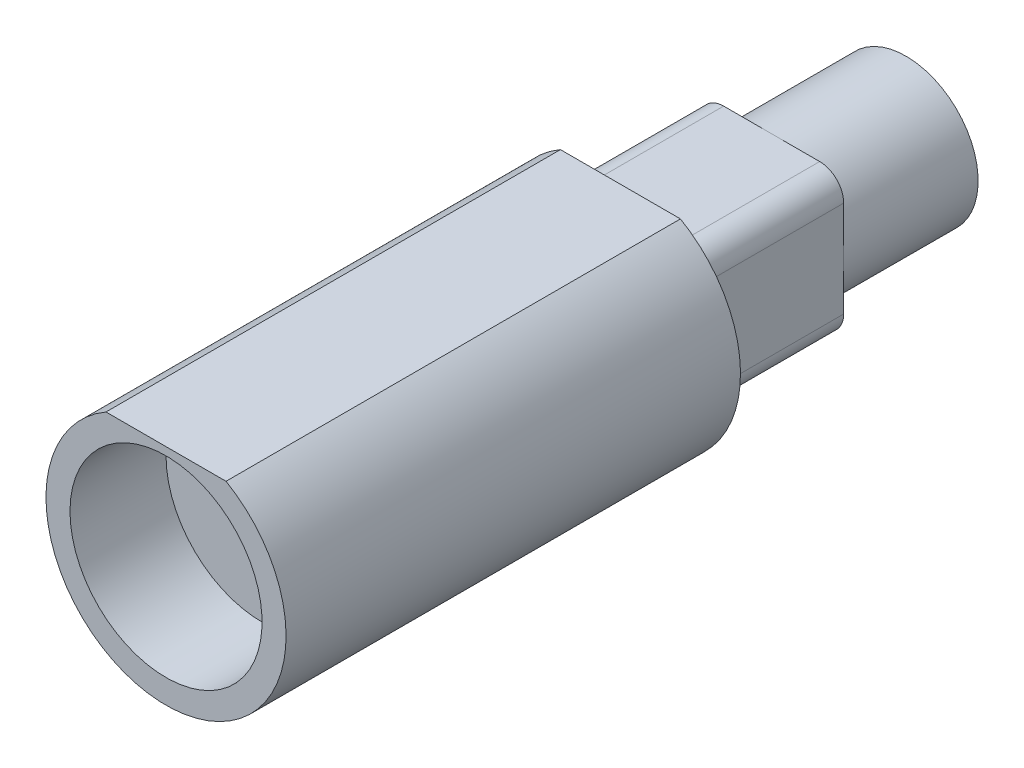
ISO-10303-21;
HEADER;
FILE_DESCRIPTION(('STEP AP214'),'2;1');
FILE_NAME('part.step','',(''),(''),'','','');
FILE_SCHEMA(('AUTOMOTIVE_DESIGN { 1 0 10303 214 1 1 1 1 }'));
ENDSEC;
DATA;
#1=APPLICATION_CONTEXT('core data for automotive mechanical design processes');
#2=APPLICATION_PROTOCOL_DEFINITION('international standard','automotive_design',2000,#1);
#3=PRODUCT_CONTEXT('',#1,'mechanical');
#4=PRODUCT('Part','Part','',(#3));
#5=PRODUCT_RELATED_PRODUCT_CATEGORY('part','',(#4));
#6=PRODUCT_DEFINITION_FORMATION('','',#4);
#7=PRODUCT_DEFINITION_CONTEXT('part definition',#1,'design');
#8=PRODUCT_DEFINITION('design','',#6,#7);
#9=PRODUCT_DEFINITION_SHAPE('','',#8);
#10=(LENGTH_UNIT() NAMED_UNIT(*) SI_UNIT(.MILLI.,.METRE.));
#11=(NAMED_UNIT(*) PLANE_ANGLE_UNIT() SI_UNIT($,.RADIAN.));
#12=(NAMED_UNIT(*) SI_UNIT($,.STERADIAN.) SOLID_ANGLE_UNIT());
#13=UNCERTAINTY_MEASURE_WITH_UNIT(LENGTH_MEASURE(1.E-05),#10,'distance_accuracy_value','');
#14=(GEOMETRIC_REPRESENTATION_CONTEXT(3) GLOBAL_UNCERTAINTY_ASSIGNED_CONTEXT((#13)) GLOBAL_UNIT_ASSIGNED_CONTEXT((#10,
#11,#12)) REPRESENTATION_CONTEXT('',''));
#15=CARTESIAN_POINT('',(0.,0.,0.));
#16=DIRECTION('',(0.,0.,1.));
#17=DIRECTION('',(1.,0.,0.));
#18=AXIS2_PLACEMENT_3D('',#15,#16,#17);
#19=CARTESIAN_POINT('',(0.,0.,-146.05));
#20=DIRECTION('',(0.,0.,1.));
#21=DIRECTION('',(1.,0.,0.));
#22=AXIS2_PLACEMENT_3D('',#19,#20,#21);
#23=PLANE('',#22);
#24=DIRECTION('',(1.,0.,0.));
#25=VECTOR('',#24,1.);
#26=CARTESIAN_POINT('',(-4.7625,-4.7625,-146.05));
#27=LINE('',#26,#25);
#28=CARTESIAN_POINT('',(-3.175,-4.7625,-146.05));
#29=VERTEX_POINT('',#28);
#30=CARTESIAN_POINT('',(0.,-4.7625,-146.05));
#31=VERTEX_POINT('',#30);
#32=EDGE_CURVE('E261',#29,#31,#27,.T.);
#33=ORIENTED_EDGE('',*,*,#32,.F.);
#34=CARTESIAN_POINT('',(-3.175,-3.175,-146.05));
#35=DIRECTION('',(0.,0.,1.));
#36=DIRECTION('',(1.,0.,0.));
#37=AXIS2_PLACEMENT_3D('',#34,#35,#36);
#38=CIRCLE('',#37,1.5875);
#39=CARTESIAN_POINT('',(-4.7625,-3.175,-146.05));
#40=VERTEX_POINT('',#39);
#41=EDGE_CURVE('E214',#29,#40,#38,.F.);
#42=ORIENTED_EDGE('',*,*,#41,.T.);
#43=DIRECTION('',(0.,1.,0.));
#44=VECTOR('',#43,1.);
#45=CARTESIAN_POINT('',(-4.7625,-4.7625,-146.05));
#46=LINE('',#45,#44);
#47=CARTESIAN_POINT('',(-4.7625,0.,-146.05));
#48=VERTEX_POINT('',#47);
#49=EDGE_CURVE('E269',#40,#48,#46,.T.);
#50=ORIENTED_EDGE('',*,*,#49,.T.);
#51=CARTESIAN_POINT('',(0.,0.,-146.05));
#52=DIRECTION('',(0.,0.,-1.));
#53=DIRECTION('',(-1.,0.,0.));
#54=AXIS2_PLACEMENT_3D('',#51,#52,#53);
#55=CIRCLE('',#54,4.7625);
#56=EDGE_CURVE('E189',#31,#48,#55,.T.);
#57=ORIENTED_EDGE('',*,*,#56,.F.);
#58=EDGE_LOOP('',(#33,#42,#50,#57));
#59=FACE_BOUND('',#58,.T.);
#60=ADVANCED_FACE('F72',(#59),#23,.F.);
#61=CARTESIAN_POINT('',(-4.7625,3.175,-146.05));
#62=VERTEX_POINT('',#61);
#63=EDGE_CURVE('E270',#48,#62,#46,.T.);
#64=ORIENTED_EDGE('',*,*,#63,.T.);
#65=CARTESIAN_POINT('',(-3.175,3.175,-146.05));
#66=DIRECTION('',(0.,0.,1.));
#67=DIRECTION('',(1.,0.,0.));
#68=AXIS2_PLACEMENT_3D('',#65,#66,#67);
#69=CIRCLE('',#68,1.5875);
#70=CARTESIAN_POINT('',(-3.175,4.7625,-146.05));
#71=VERTEX_POINT('',#70);
#72=EDGE_CURVE('E196',#62,#71,#69,.F.);
#73=ORIENTED_EDGE('',*,*,#72,.T.);
#74=DIRECTION('',(1.,0.,0.));
#75=VECTOR('',#74,1.);
#76=CARTESIAN_POINT('',(-4.7625,4.7625,-146.05));
#77=LINE('',#76,#75);
#78=CARTESIAN_POINT('',(0.,4.7625,-146.05));
#79=VERTEX_POINT('',#78);
#80=EDGE_CURVE('E255',#71,#79,#77,.T.);
#81=ORIENTED_EDGE('',*,*,#80,.T.);
#82=EDGE_CURVE('E183',#48,#79,#55,.T.);
#83=ORIENTED_EDGE('',*,*,#82,.F.);
#84=EDGE_LOOP('',(#64,#73,#81,#83));
#85=FACE_BOUND('',#84,.T.);
#86=ADVANCED_FACE('F293',(#85),#23,.F.);
#87=DIRECTION('',(0.,1.,0.));
#88=VECTOR('',#87,1.);
#89=CARTESIAN_POINT('',(4.7625,-4.7625,-146.05));
#90=LINE('',#89,#88);
#91=CARTESIAN_POINT('',(4.7625,-3.175,-146.05));
#92=VERTEX_POINT('',#91);
#93=CARTESIAN_POINT('',(4.7625,0.,-146.05));
#94=VERTEX_POINT('',#93);
#95=EDGE_CURVE('E254',#92,#94,#90,.T.);
#96=ORIENTED_EDGE('',*,*,#95,.F.);
#97=CARTESIAN_POINT('',(3.175,-3.175,-146.05));
#98=DIRECTION('',(0.,0.,1.));
#99=DIRECTION('',(1.,0.,0.));
#100=AXIS2_PLACEMENT_3D('',#97,#98,#99);
#101=CIRCLE('',#100,1.5875);
#102=CARTESIAN_POINT('',(3.175,-4.7625,-146.05));
#103=VERTEX_POINT('',#102);
#104=EDGE_CURVE('E216',#92,#103,#101,.F.);
#105=ORIENTED_EDGE('',*,*,#104,.T.);
#106=EDGE_CURVE('E257',#31,#103,#27,.T.);
#107=ORIENTED_EDGE('',*,*,#106,.F.);
#108=EDGE_CURVE('E265',#94,#31,#55,.T.);
#109=ORIENTED_EDGE('',*,*,#108,.F.);
#110=EDGE_LOOP('',(#96,#105,#107,#109));
#111=FACE_BOUND('',#110,.T.);
#112=ADVANCED_FACE('F304',(#111),#23,.F.);
#113=CARTESIAN_POINT('',(3.175,4.7625,-146.05));
#114=VERTEX_POINT('',#113);
#115=EDGE_CURVE('E250',#79,#114,#77,.T.);
#116=ORIENTED_EDGE('',*,*,#115,.T.);
#117=CARTESIAN_POINT('',(3.175,3.175,-146.05));
#118=DIRECTION('',(0.,0.,1.));
#119=DIRECTION('',(1.,0.,0.));
#120=AXIS2_PLACEMENT_3D('',#117,#118,#119);
#121=CIRCLE('',#120,1.5875);
#122=CARTESIAN_POINT('',(4.7625,3.175,-146.05));
#123=VERTEX_POINT('',#122);
#124=EDGE_CURVE('E203',#114,#123,#121,.F.);
#125=ORIENTED_EDGE('',*,*,#124,.T.);
#126=EDGE_CURVE('E248',#94,#123,#90,.T.);
#127=ORIENTED_EDGE('',*,*,#126,.F.);
#128=EDGE_CURVE('E187',#79,#94,#55,.T.);
#129=ORIENTED_EDGE('',*,*,#128,.F.);
#130=EDGE_LOOP('',(#116,#125,#127,#129));
#131=FACE_BOUND('',#130,.T.);
#132=ADVANCED_FACE('F246',(#131),#23,.F.);
#133=CARTESIAN_POINT('',(0.,0.,-146.05));
#134=DIRECTION('',(0.,0.,-1.));
#135=DIRECTION('',(-1.,0.,0.));
#136=AXIS2_PLACEMENT_3D('',#133,#134,#135);
#137=CYLINDRICAL_SURFACE('',#136,4.7625);
#138=ORIENTED_EDGE('',*,*,#82,.T.);
#139=ORIENTED_EDGE('',*,*,#128,.T.);
#140=ORIENTED_EDGE('',*,*,#108,.T.);
#141=ORIENTED_EDGE('',*,*,#56,.T.);
#142=EDGE_LOOP('',(#138,#139,#140,#141));
#143=FACE_BOUND('',#142,.T.);
#144=CARTESIAN_POINT('',(0.,0.,-154.94));
#145=DIRECTION('',(0.,0.,-1.));
#146=DIRECTION('',(-1.,0.,0.));
#147=AXIS2_PLACEMENT_3D('',#144,#145,#146);
#148=CIRCLE('',#147,4.7625);
#149=CARTESIAN_POINT('',(-4.7625,0.,-154.94));
#150=VERTEX_POINT('',#149);
#151=EDGE_CURVE('E178',#150,#150,#148,.T.);
#152=ORIENTED_EDGE('',*,*,#151,.F.);
#153=EDGE_LOOP('',(#152));
#154=FACE_BOUND('',#153,.T.);
#155=ADVANCED_FACE('F297',(#143,#154),#137,.T.);
#156=CARTESIAN_POINT('',(0.,0.,-136.05));
#157=DIRECTION('',(0.,0.,-1.));
#158=DIRECTION('',(-1.,0.,0.));
#159=AXIS2_PLACEMENT_3D('',#156,#157,#158);
#160=PLANE('',#159);
#161=DIRECTION('',(0.,1.,0.));
#162=VECTOR('',#161,1.);
#163=CARTESIAN_POINT('',(-4.7625,-4.7625,-136.05));
#164=LINE('',#163,#162);
#165=CARTESIAN_POINT('',(-4.7625,-3.175,-136.05));
#166=VERTEX_POINT('',#165);
#167=CARTESIAN_POINT('',(-4.7625,3.175,-136.05));
#168=VERTEX_POINT('',#167);
#169=EDGE_CURVE('E240',#166,#168,#164,.T.);
#170=ORIENTED_EDGE('',*,*,#169,.F.);
#171=CARTESIAN_POINT('',(-3.175,-3.175,-136.05));
#172=DIRECTION('',(0.,0.,-1.));
#173=DIRECTION('',(-1.,0.,0.));
#174=AXIS2_PLACEMENT_3D('',#171,#172,#173);
#175=CIRCLE('',#174,1.5875);
#176=CARTESIAN_POINT('',(-3.175,-4.7625,-136.05));
#177=VERTEX_POINT('',#176);
#178=EDGE_CURVE('E80',#166,#177,#175,.F.);
#179=ORIENTED_EDGE('',*,*,#178,.T.);
#180=DIRECTION('',(1.,0.,0.));
#181=VECTOR('',#180,1.);
#182=CARTESIAN_POINT('',(-4.7625,-4.7625,-136.05));
#183=LINE('',#182,#181);
#184=CARTESIAN_POINT('',(3.175,-4.7625,-136.05));
#185=VERTEX_POINT('',#184);
#186=EDGE_CURVE('E263',#177,#185,#183,.T.);
#187=ORIENTED_EDGE('',*,*,#186,.T.);
#188=CARTESIAN_POINT('',(3.175,-3.175,-136.05));
#189=DIRECTION('',(0.,0.,-1.));
#190=DIRECTION('',(-1.,0.,0.));
#191=AXIS2_PLACEMENT_3D('',#188,#189,#190);
#192=CIRCLE('',#191,1.5875);
#193=CARTESIAN_POINT('',(4.7625,-3.175,-136.05));
#194=VERTEX_POINT('',#193);
#195=EDGE_CURVE('E12',#185,#194,#192,.F.);
#196=ORIENTED_EDGE('',*,*,#195,.T.);
#197=DIRECTION('',(0.,1.,0.));
#198=VECTOR('',#197,1.);
#199=CARTESIAN_POINT('',(4.7625,-4.7625,-136.05));
#200=LINE('',#199,#198);
#201=CARTESIAN_POINT('',(4.7625,3.175,-136.05));
#202=VERTEX_POINT('',#201);
#203=EDGE_CURVE('E230',#194,#202,#200,.T.);
#204=ORIENTED_EDGE('',*,*,#203,.T.);
#205=CARTESIAN_POINT('',(3.175,3.175,-136.05));
#206=DIRECTION('',(0.,0.,-1.));
#207=DIRECTION('',(-1.,0.,0.));
#208=AXIS2_PLACEMENT_3D('',#205,#206,#207);
#209=CIRCLE('',#208,1.5875);
#210=CARTESIAN_POINT('',(3.175,4.7625,-136.05));
#211=VERTEX_POINT('',#210);
#212=EDGE_CURVE('E220',#202,#211,#209,.F.);
#213=ORIENTED_EDGE('',*,*,#212,.T.);
#214=DIRECTION('',(1.,0.,0.));
#215=VECTOR('',#214,1.);
#216=CARTESIAN_POINT('',(-4.7625,4.7625,-136.05));
#217=LINE('',#216,#215);
#218=CARTESIAN_POINT('',(-3.175,4.7625,-136.05));
#219=VERTEX_POINT('',#218);
#220=EDGE_CURVE('E227',#219,#211,#217,.T.);
#221=ORIENTED_EDGE('',*,*,#220,.F.);
#222=CARTESIAN_POINT('',(-3.175,3.175,-136.05));
#223=DIRECTION('',(0.,0.,-1.));
#224=DIRECTION('',(-1.,0.,0.));
#225=AXIS2_PLACEMENT_3D('',#222,#223,#224);
#226=CIRCLE('',#225,1.5875);
#227=EDGE_CURVE('E218',#219,#168,#226,.F.);
#228=ORIENTED_EDGE('',*,*,#227,.T.);
#229=EDGE_LOOP('',(#170,#179,#187,#196,#204,#213,#221,#228));
#230=FACE_BOUND('',#229,.T.);
#231=DIRECTION('',(1.,0.,0.));
#232=VECTOR('',#231,1.);
#233=CARTESIAN_POINT('',(-3.96875,6.87407664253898,-136.05));
#234=LINE('',#233,#232);
#235=CARTESIAN_POINT('',(-3.96875,6.87407664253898,-136.05));
#236=VERTEX_POINT('',#235);
#237=CARTESIAN_POINT('',(3.96875,6.87407664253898,-136.05));
#238=VERTEX_POINT('',#237);
#239=EDGE_CURVE('E182',#236,#238,#234,.T.);
#240=ORIENTED_EDGE('',*,*,#239,.T.);
#241=CARTESIAN_POINT('',(0.,0.,-136.05));
#242=DIRECTION('',(0.,0.,-1.));
#243=DIRECTION('',(-1.,0.,0.));
#244=AXIS2_PLACEMENT_3D('',#241,#242,#243);
#245=CIRCLE('',#244,7.9375);
#246=EDGE_CURVE('E169',#238,#236,#245,.T.);
#247=ORIENTED_EDGE('',*,*,#246,.T.);
#248=EDGE_LOOP('',(#240,#247));
#249=FACE_BOUND('',#248,.T.);
#250=ADVANCED_FACE('F225',(#230,#249),#160,.T.);
#251=CARTESIAN_POINT('',(-4.7625,-4.7625,-136.05));
#252=DIRECTION('',(-1.,0.,0.));
#253=DIRECTION('',(0.,0.,1.));
#254=AXIS2_PLACEMENT_3D('',#251,#252,#253);
#255=PLANE('',#254);
#256=ORIENTED_EDGE('',*,*,#169,.T.);
#257=DIRECTION('',(0.,0.,-1.));
#258=VECTOR('',#257,1.);
#259=CARTESIAN_POINT('',(-4.7625,3.175,-136.05));
#260=LINE('',#259,#258);
#261=EDGE_CURVE('E193',#168,#62,#260,.T.);
#262=ORIENTED_EDGE('',*,*,#261,.T.);
#263=ORIENTED_EDGE('',*,*,#63,.F.);
#264=ORIENTED_EDGE('',*,*,#49,.F.);
#265=DIRECTION('',(0.,0.,-1.));
#266=VECTOR('',#265,1.);
#267=CARTESIAN_POINT('',(-4.7625,-3.175,-136.05));
#268=LINE('',#267,#266);
#269=EDGE_CURVE('E168',#40,#166,#268,.F.);
#270=ORIENTED_EDGE('',*,*,#269,.T.);
#271=EDGE_LOOP('',(#256,#262,#263,#264,#270));
#272=FACE_BOUND('',#271,.T.);
#273=ADVANCED_FACE('F289',(#272),#255,.T.);
#274=CARTESIAN_POINT('',(-4.7625,-4.7625,-136.05));
#275=DIRECTION('',(0.,1.,0.));
#276=DIRECTION('',(0.,0.,1.));
#277=AXIS2_PLACEMENT_3D('',#274,#275,#276);
#278=PLANE('',#277);
#279=ORIENTED_EDGE('',*,*,#186,.F.);
#280=DIRECTION('',(0.,0.,-1.));
#281=VECTOR('',#280,1.);
#282=CARTESIAN_POINT('',(-3.175,-4.7625,-146.05));
#283=LINE('',#282,#281);
#284=EDGE_CURVE('E211',#177,#29,#283,.T.);
#285=ORIENTED_EDGE('',*,*,#284,.T.);
#286=ORIENTED_EDGE('',*,*,#32,.T.);
#287=ORIENTED_EDGE('',*,*,#106,.T.);
#288=DIRECTION('',(0.,0.,-1.));
#289=VECTOR('',#288,1.);
#290=CARTESIAN_POINT('',(3.175,-4.7625,-136.05));
#291=LINE('',#290,#289);
#292=EDGE_CURVE('E87',#103,#185,#291,.F.);
#293=ORIENTED_EDGE('',*,*,#292,.T.);
#294=EDGE_LOOP('',(#279,#285,#286,#287,#293));
#295=FACE_BOUND('',#294,.T.);
#296=ADVANCED_FACE('F301',(#295),#278,.F.);
#297=CARTESIAN_POINT('',(4.7625,-4.7625,-136.05));
#298=DIRECTION('',(-1.,0.,0.));
#299=DIRECTION('',(0.,0.,1.));
#300=AXIS2_PLACEMENT_3D('',#297,#298,#299);
#301=PLANE('',#300);
#302=ORIENTED_EDGE('',*,*,#126,.T.);
#303=DIRECTION('',(0.,0.,-1.));
#304=VECTOR('',#303,1.);
#305=CARTESIAN_POINT('',(4.7625,3.175,-136.05));
#306=LINE('',#305,#304);
#307=EDGE_CURVE('E208',#123,#202,#306,.F.);
#308=ORIENTED_EDGE('',*,*,#307,.T.);
#309=ORIENTED_EDGE('',*,*,#203,.F.);
#310=DIRECTION('',(0.,0.,-1.));
#311=VECTOR('',#310,1.);
#312=CARTESIAN_POINT('',(4.7625,-3.175,-136.05));
#313=LINE('',#312,#311);
#314=EDGE_CURVE('E205',#194,#92,#313,.T.);
#315=ORIENTED_EDGE('',*,*,#314,.T.);
#316=ORIENTED_EDGE('',*,*,#95,.T.);
#317=EDGE_LOOP('',(#302,#308,#309,#315,#316));
#318=FACE_BOUND('',#317,.T.);
#319=ADVANCED_FACE('F252',(#318),#301,.F.);
#320=CARTESIAN_POINT('',(-4.7625,4.7625,-136.05));
#321=DIRECTION('',(0.,1.,0.));
#322=DIRECTION('',(0.,0.,1.));
#323=AXIS2_PLACEMENT_3D('',#320,#321,#322);
#324=PLANE('',#323);
#325=ORIENTED_EDGE('',*,*,#80,.F.);
#326=DIRECTION('',(0.,0.,-1.));
#327=VECTOR('',#326,1.);
#328=CARTESIAN_POINT('',(-3.175,4.7625,-136.05));
#329=LINE('',#328,#327);
#330=EDGE_CURVE('E201',#71,#219,#329,.F.);
#331=ORIENTED_EDGE('',*,*,#330,.T.);
#332=ORIENTED_EDGE('',*,*,#220,.T.);
#333=DIRECTION('',(0.,0.,-1.));
#334=VECTOR('',#333,1.);
#335=CARTESIAN_POINT('',(3.175,4.7625,-146.05));
#336=LINE('',#335,#334);
#337=EDGE_CURVE('E198',#211,#114,#336,.T.);
#338=ORIENTED_EDGE('',*,*,#337,.T.);
#339=ORIENTED_EDGE('',*,*,#115,.F.);
#340=EDGE_LOOP('',(#325,#331,#332,#338,#339));
#341=FACE_BOUND('',#340,.T.);
#342=ADVANCED_FACE('F236',(#341),#324,.T.);
#343=CARTESIAN_POINT('',(0.,0.,152.4));
#344=DIRECTION('',(0.,0.,-1.));
#345=DIRECTION('',(-1.,0.,0.));
#346=AXIS2_PLACEMENT_3D('',#343,#344,#345);
#347=CYLINDRICAL_SURFACE('',#346,7.9375);
#348=DIRECTION('',(0.,0.,1.));
#349=VECTOR('',#348,1.);
#350=CARTESIAN_POINT('',(3.96875,6.87407664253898,-152.4));
#351=LINE('',#350,#349);
#352=CARTESIAN_POINT('',(3.96875,6.87407664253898,-106.00145424));
#353=VERTEX_POINT('',#352);
#354=EDGE_CURVE('E176',#238,#353,#351,.T.);
#355=ORIENTED_EDGE('',*,*,#354,.T.);
#356=CARTESIAN_POINT('',(0.,0.,-106.00145424));
#357=DIRECTION('',(0.,0.,-1.));
#358=DIRECTION('',(-1.,0.,0.));
#359=AXIS2_PLACEMENT_3D('',#356,#357,#358);
#360=CIRCLE('',#359,7.9375);
#361=CARTESIAN_POINT('',(-3.96874999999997,6.874076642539,-106.00145424));
#362=VERTEX_POINT('',#361);
#363=EDGE_CURVE('E163',#353,#362,#360,.T.);
#364=ORIENTED_EDGE('',*,*,#363,.T.);
#365=DIRECTION('',(0.,0.,1.));
#366=VECTOR('',#365,1.);
#367=CARTESIAN_POINT('',(-3.96875,6.87407664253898,-152.4));
#368=LINE('',#367,#366);
#369=EDGE_CURVE('E175',#236,#362,#368,.T.);
#370=ORIENTED_EDGE('',*,*,#369,.F.);
#371=ORIENTED_EDGE('',*,*,#246,.F.);
#372=EDGE_LOOP('',(#355,#364,#370,#371));
#373=FACE_BOUND('',#372,.T.);
#374=ADVANCED_FACE('F173',(#373),#347,.T.);
#375=CARTESIAN_POINT('',(-3.96875,6.87407664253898,-152.4));
#376=DIRECTION('',(0.,-1.,0.));
#377=DIRECTION('',(0.,0.,-1.));
#378=AXIS2_PLACEMENT_3D('',#375,#376,#377);
#379=PLANE('',#378);
#380=ORIENTED_EDGE('',*,*,#369,.T.);
#381=DIRECTION('',(1.,0.,0.));
#382=VECTOR('',#381,1.);
#383=CARTESIAN_POINT('',(-3.96875,6.87407664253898,-106.00145424));
#384=LINE('',#383,#382);
#385=EDGE_CURVE('E160',#362,#353,#384,.T.);
#386=ORIENTED_EDGE('',*,*,#385,.T.);
#387=ORIENTED_EDGE('',*,*,#354,.F.);
#388=ORIENTED_EDGE('',*,*,#239,.F.);
#389=EDGE_LOOP('',(#380,#386,#387,#388));
#390=FACE_BOUND('',#389,.T.);
#391=ADVANCED_FACE('F181',(#390),#379,.F.);
#392=CARTESIAN_POINT('',(-7.9375,0.,-106.00145424));
#393=DIRECTION('',(0.,0.,-1.));
#394=DIRECTION('',(-1.,0.,0.));
#395=AXIS2_PLACEMENT_3D('',#392,#393,#394);
#396=PLANE('',#395);
#397=CARTESIAN_POINT('',(0.,0.,-106.00145424));
#398=DIRECTION('',(0.,0.,-1.));
#399=DIRECTION('',(-1.,0.,0.));
#400=AXIS2_PLACEMENT_3D('',#397,#398,#399);
#401=CIRCLE('',#400,6.34999999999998);
#402=CARTESIAN_POINT('',(-6.34999999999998,0.,-106.00145424));
#403=VERTEX_POINT('',#402);
#404=EDGE_CURVE('E177',#403,#403,#401,.T.);
#405=ORIENTED_EDGE('',*,*,#404,.T.);
#406=EDGE_LOOP('',(#405));
#407=FACE_BOUND('',#406,.T.);
#408=ORIENTED_EDGE('',*,*,#363,.F.);
#409=ORIENTED_EDGE('',*,*,#385,.F.);
#410=EDGE_LOOP('',(#408,#409));
#411=FACE_BOUND('',#410,.T.);
#412=ADVANCED_FACE('F162',(#407,#411),#396,.F.);
#413=CARTESIAN_POINT('',(-6.34999999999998,0.,-112.35145424));
#414=DIRECTION('',(0.,0.,-1.));
#415=DIRECTION('',(-1.,0.,0.));
#416=AXIS2_PLACEMENT_3D('',#413,#414,#415);
#417=PLANE('',#416);
#418=CARTESIAN_POINT('',(0.,0.,-112.35145424));
#419=DIRECTION('',(0.,0.,-1.));
#420=DIRECTION('',(-1.,0.,0.));
#421=AXIS2_PLACEMENT_3D('',#418,#419,#420);
#422=CIRCLE('',#421,6.34999999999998);
#423=CARTESIAN_POINT('',(-6.34999999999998,0.,-112.35145424));
#424=VERTEX_POINT('',#423);
#425=EDGE_CURVE('E276',#424,#424,#422,.T.);
#426=ORIENTED_EDGE('',*,*,#425,.F.);
#427=EDGE_LOOP('',(#426));
#428=FACE_BOUND('',#427,.T.);
#429=ADVANCED_FACE('F350',(#428),#417,.F.);
#430=CARTESIAN_POINT('',(0.,0.,0.));
#431=DIRECTION('',(0.,0.,-1.));
#432=DIRECTION('',(-1.,0.,0.));
#433=AXIS2_PLACEMENT_3D('',#430,#431,#432);
#434=CYLINDRICAL_SURFACE('',#433,6.34999999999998);
#435=ORIENTED_EDGE('',*,*,#404,.F.);
#436=EDGE_LOOP('',(#435));
#437=FACE_BOUND('',#436,.T.);
#438=ORIENTED_EDGE('',*,*,#425,.T.);
#439=EDGE_LOOP('',(#438));
#440=FACE_BOUND('',#439,.T.);
#441=ADVANCED_FACE('F345',(#437,#440),#434,.F.);
#442=CARTESIAN_POINT('',(-3.175,3.175,-136.05));
#443=DIRECTION('',(0.,0.,-1.));
#444=DIRECTION('',(-1.,0.,0.));
#445=AXIS2_PLACEMENT_3D('',#442,#443,#444);
#446=CYLINDRICAL_SURFACE('',#445,1.5875);
#447=ORIENTED_EDGE('',*,*,#227,.F.);
#448=ORIENTED_EDGE('',*,*,#330,.F.);
#449=ORIENTED_EDGE('',*,*,#72,.F.);
#450=ORIENTED_EDGE('',*,*,#261,.F.);
#451=EDGE_LOOP('',(#447,#448,#449,#450));
#452=FACE_BOUND('',#451,.T.);
#453=ADVANCED_FACE('F292',(#452),#446,.T.);
#454=CARTESIAN_POINT('',(3.175,3.175,-136.05));
#455=DIRECTION('',(0.,0.,1.));
#456=DIRECTION('',(1.,0.,0.));
#457=AXIS2_PLACEMENT_3D('',#454,#455,#456);
#458=CYLINDRICAL_SURFACE('',#457,1.5875);
#459=ORIENTED_EDGE('',*,*,#212,.F.);
#460=ORIENTED_EDGE('',*,*,#307,.F.);
#461=ORIENTED_EDGE('',*,*,#124,.F.);
#462=ORIENTED_EDGE('',*,*,#337,.F.);
#463=EDGE_LOOP('',(#459,#460,#461,#462));
#464=FACE_BOUND('',#463,.T.);
#465=ADVANCED_FACE('F242',(#464),#458,.T.);
#466=CARTESIAN_POINT('',(-3.175,-3.175,-136.05));
#467=DIRECTION('',(0.,0.,1.));
#468=DIRECTION('',(1.,0.,0.));
#469=AXIS2_PLACEMENT_3D('',#466,#467,#468);
#470=CYLINDRICAL_SURFACE('',#469,1.5875);
#471=ORIENTED_EDGE('',*,*,#178,.F.);
#472=ORIENTED_EDGE('',*,*,#269,.F.);
#473=ORIENTED_EDGE('',*,*,#41,.F.);
#474=ORIENTED_EDGE('',*,*,#284,.F.);
#475=EDGE_LOOP('',(#471,#472,#473,#474));
#476=FACE_BOUND('',#475,.T.);
#477=ADVANCED_FACE('F309',(#476),#470,.T.);
#478=CARTESIAN_POINT('',(3.175,-3.175,-136.05));
#479=DIRECTION('',(0.,0.,-1.));
#480=DIRECTION('',(-1.,0.,0.));
#481=AXIS2_PLACEMENT_3D('',#478,#479,#480);
#482=CYLINDRICAL_SURFACE('',#481,1.5875);
#483=ORIENTED_EDGE('',*,*,#195,.F.);
#484=ORIENTED_EDGE('',*,*,#292,.F.);
#485=ORIENTED_EDGE('',*,*,#104,.F.);
#486=ORIENTED_EDGE('',*,*,#314,.F.);
#487=EDGE_LOOP('',(#483,#484,#485,#486));
#488=FACE_BOUND('',#487,.T.);
#489=ADVANCED_FACE('F74',(#488),#482,.T.);
#490=CARTESIAN_POINT('',(0.,0.,-154.94));
#491=DIRECTION('',(0.,0.,-1.));
#492=DIRECTION('',(-1.,0.,0.));
#493=AXIS2_PLACEMENT_3D('',#490,#491,#492);
#494=PLANE('',#493);
#495=ORIENTED_EDGE('',*,*,#151,.T.);
#496=EDGE_LOOP('',(#495));
#497=FACE_BOUND('',#496,.T.);
#498=ADVANCED_FACE('F308',(#497),#494,.T.);
#499=CLOSED_SHELL('',(#60,#86,#112,#132,#155,#250,#273,#296,#319,#342,#374,#391,#412,#429,#441,
#453,#465,#477,#489,#498));
#500=MANIFOLD_SOLID_BREP('B2',#499);
#501=ADVANCED_BREP_SHAPE_REPRESENTATION('',(#18,#500),#14);
#502=SHAPE_DEFINITION_REPRESENTATION(#9,#501);
ENDSEC;
END-ISO-10303-21;
